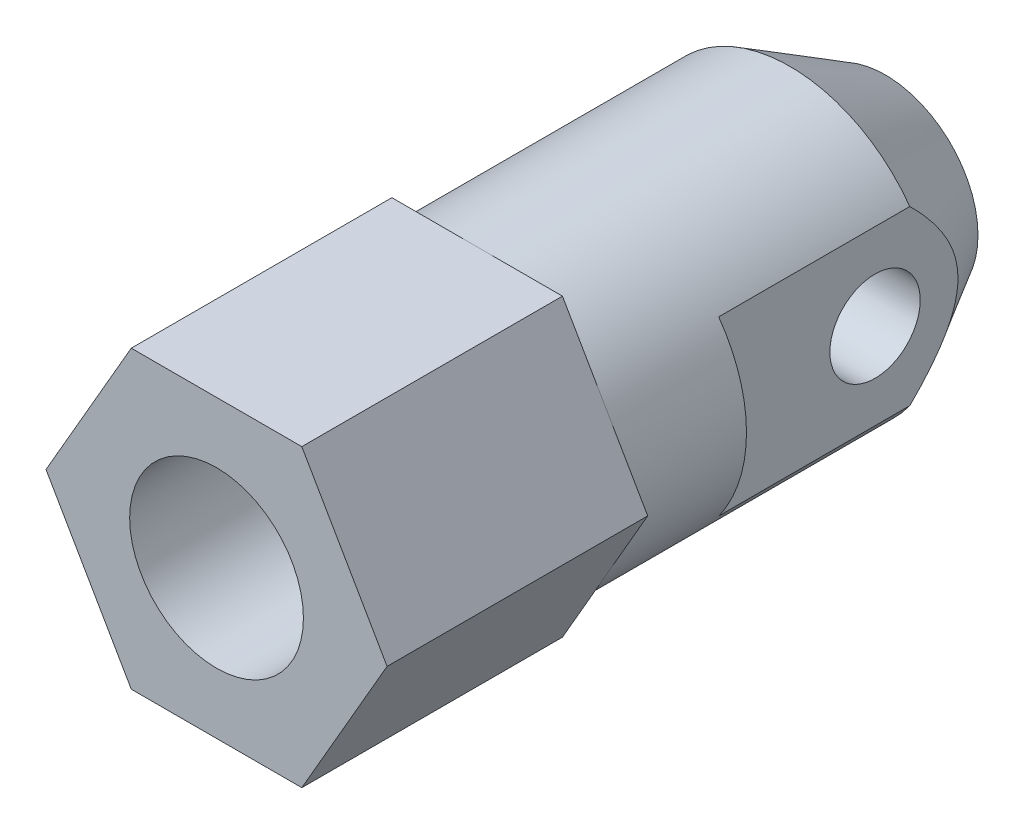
ISO-10303-21;
HEADER;
FILE_DESCRIPTION(('STEP AP214'),'2;1');
FILE_NAME('part.step','',(''),(''),'','','');
FILE_SCHEMA(('AUTOMOTIVE_DESIGN { 1 0 10303 214 1 1 1 1 }'));
ENDSEC;
DATA;
#1=APPLICATION_CONTEXT('core data for automotive mechanical design processes');
#2=APPLICATION_PROTOCOL_DEFINITION('international standard','automotive_design',2000,#1);
#3=PRODUCT_CONTEXT('',#1,'mechanical');
#4=PRODUCT('Part','Part','',(#3));
#5=PRODUCT_RELATED_PRODUCT_CATEGORY('part','',(#4));
#6=PRODUCT_DEFINITION_FORMATION('','',#4);
#7=PRODUCT_DEFINITION_CONTEXT('part definition',#1,'design');
#8=PRODUCT_DEFINITION('design','',#6,#7);
#9=PRODUCT_DEFINITION_SHAPE('','',#8);
#10=(LENGTH_UNIT() NAMED_UNIT(*) SI_UNIT(.MILLI.,.METRE.));
#11=(NAMED_UNIT(*) PLANE_ANGLE_UNIT() SI_UNIT($,.RADIAN.));
#12=(NAMED_UNIT(*) SI_UNIT($,.STERADIAN.) SOLID_ANGLE_UNIT());
#13=UNCERTAINTY_MEASURE_WITH_UNIT(LENGTH_MEASURE(1.E-05),#10,'distance_accuracy_value','');
#14=(GEOMETRIC_REPRESENTATION_CONTEXT(3) GLOBAL_UNCERTAINTY_ASSIGNED_CONTEXT((#13)) GLOBAL_UNIT_ASSIGNED_CONTEXT((#10,
#11,#12)) REPRESENTATION_CONTEXT('',''));
#15=CARTESIAN_POINT('',(0.,0.,0.));
#16=DIRECTION('',(0.,0.,1.));
#17=DIRECTION('',(1.,0.,0.));
#18=AXIS2_PLACEMENT_3D('',#15,#16,#17);
#19=CARTESIAN_POINT('',(0.,0.,11.));
#20=DIRECTION('',(0.,0.,-1.));
#21=DIRECTION('',(1.,0.,0.));
#22=AXIS2_PLACEMENT_3D('',#19,#20,#21);
#23=CYLINDRICAL_SURFACE('',#22,8.5);
#24=CARTESIAN_POINT('',(0.,0.,16.));
#25=DIRECTION('',(0.,0.,-1.));
#26=DIRECTION('',(1.,0.,0.));
#27=AXIS2_PLACEMENT_3D('',#24,#25,#26);
#28=CIRCLE('',#27,8.5);
#29=CARTESIAN_POINT('',(7.36121593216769,4.25,16.));
#30=VERTEX_POINT('',#29);
#31=CARTESIAN_POINT('',(0.,8.5,16.));
#32=VERTEX_POINT('',#31);
#33=EDGE_CURVE('E9',#30,#32,#28,.F.);
#34=ORIENTED_EDGE('',*,*,#33,.F.);
#35=CARTESIAN_POINT('',(7.36121593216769,-4.24999999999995,16.));
#36=VERTEX_POINT('',#35);
#37=EDGE_CURVE('E18',#36,#30,#28,.F.);
#38=ORIENTED_EDGE('',*,*,#37,.F.);
#39=CARTESIAN_POINT('',(0.,-8.5,16.));
#40=VERTEX_POINT('',#39);
#41=EDGE_CURVE('E247',#40,#36,#28,.F.);
#42=ORIENTED_EDGE('',*,*,#41,.F.);
#43=CARTESIAN_POINT('',(-7.36121593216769,-4.24999999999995,16.));
#44=VERTEX_POINT('',#43);
#45=EDGE_CURVE('E252',#44,#40,#28,.F.);
#46=ORIENTED_EDGE('',*,*,#45,.F.);
#47=CARTESIAN_POINT('',(-7.36121593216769,4.25,16.));
#48=VERTEX_POINT('',#47);
#49=EDGE_CURVE('E33',#48,#44,#28,.F.);
#50=ORIENTED_EDGE('',*,*,#49,.F.);
#51=EDGE_CURVE('E23',#32,#48,#28,.F.);
#52=ORIENTED_EDGE('',*,*,#51,.F.);
#53=EDGE_LOOP('',(#34,#38,#42,#46,#50,#52));
#54=FACE_BOUND('',#53,.T.);
#55=CARTESIAN_POINT('',(0.,0.,-2.));
#56=DIRECTION('',(0.,0.,-1.));
#57=DIRECTION('',(1.,0.,0.));
#58=AXIS2_PLACEMENT_3D('',#55,#56,#57);
#59=CIRCLE('',#58,8.5);
#60=CARTESIAN_POINT('',(-6.9,4.96386945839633,-2.));
#61=VERTEX_POINT('',#60);
#62=CARTESIAN_POINT('',(6.9,4.96386945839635,-2.));
#63=VERTEX_POINT('',#62);
#64=EDGE_CURVE('E176',#61,#63,#59,.T.);
#65=ORIENTED_EDGE('',*,*,#64,.F.);
#66=DIRECTION('',(0.,0.,-1.));
#67=VECTOR('',#66,1.);
#68=CARTESIAN_POINT('',(-6.9,4.96386945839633,11.));
#69=LINE('',#68,#67);
#70=CARTESIAN_POINT('',(-6.9,4.96386945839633,9.));
#71=VERTEX_POINT('',#70);
#72=EDGE_CURVE('E163',#61,#71,#69,.F.);
#73=ORIENTED_EDGE('',*,*,#72,.T.);
#74=CARTESIAN_POINT('',(0.,0.,9.));
#75=DIRECTION('',(0.,0.,1.));
#76=DIRECTION('',(-1.,0.,0.));
#77=AXIS2_PLACEMENT_3D('',#74,#75,#76);
#78=CIRCLE('',#77,8.5);
#79=CARTESIAN_POINT('',(-6.9,-4.96386945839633,9.));
#80=VERTEX_POINT('',#79);
#81=EDGE_CURVE('E208',#80,#71,#78,.F.);
#82=ORIENTED_EDGE('',*,*,#81,.F.);
#83=DIRECTION('',(0.,0.,-1.));
#84=VECTOR('',#83,1.);
#85=CARTESIAN_POINT('',(-6.9,-4.96386945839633,11.));
#86=LINE('',#85,#84);
#87=CARTESIAN_POINT('',(-6.9,-4.96386945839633,-2.));
#88=VERTEX_POINT('',#87);
#89=EDGE_CURVE('E160',#80,#88,#86,.T.);
#90=ORIENTED_EDGE('',*,*,#89,.T.);
#91=CARTESIAN_POINT('',(6.9,-4.96386945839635,-2.));
#92=VERTEX_POINT('',#91);
#93=EDGE_CURVE('E177',#92,#88,#59,.T.);
#94=ORIENTED_EDGE('',*,*,#93,.F.);
#95=DIRECTION('',(0.,0.,-1.));
#96=VECTOR('',#95,1.);
#97=CARTESIAN_POINT('',(6.9,-4.96386945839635,11.));
#98=LINE('',#97,#96);
#99=CARTESIAN_POINT('',(6.9,-4.96386945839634,9.));
#100=VERTEX_POINT('',#99);
#101=EDGE_CURVE('E169',#100,#92,#98,.T.);
#102=ORIENTED_EDGE('',*,*,#101,.F.);
#103=CARTESIAN_POINT('',(0.,0.,9.));
#104=DIRECTION('',(0.,0.,-1.));
#105=DIRECTION('',(1.,0.,0.));
#106=AXIS2_PLACEMENT_3D('',#103,#104,#105);
#107=CIRCLE('',#106,8.5);
#108=CARTESIAN_POINT('',(6.9,4.96386945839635,9.));
#109=VERTEX_POINT('',#108);
#110=EDGE_CURVE('E189',#100,#109,#107,.F.);
#111=ORIENTED_EDGE('',*,*,#110,.T.);
#112=DIRECTION('',(0.,0.,-1.));
#113=VECTOR('',#112,1.);
#114=CARTESIAN_POINT('',(6.9,4.96386945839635,11.));
#115=LINE('',#114,#113);
#116=EDGE_CURVE('E171',#63,#109,#115,.F.);
#117=ORIENTED_EDGE('',*,*,#116,.F.);
#118=EDGE_LOOP('',(#65,#73,#82,#90,#94,#102,#111,#117));
#119=FACE_BOUND('',#118,.T.);
#120=ADVANCED_FACE('F14',(#54,#119),#23,.T.);
#121=CARTESIAN_POINT('',(0.,0.,-7.5));
#122=DIRECTION('',(0.,0.,1.));
#123=DIRECTION('',(-1.,0.,0.));
#124=AXIS2_PLACEMENT_3D('',#121,#122,#123);
#125=CONICAL_SURFACE('',#124,5.32457351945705,0.523598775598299);
#126=CARTESIAN_POINT('',(0.,0.,-7.5));
#127=DIRECTION('',(0.,0.,-1.));
#128=DIRECTION('',(1.,0.,0.));
#129=AXIS2_PLACEMENT_3D('',#126,#127,#128);
#130=CIRCLE('',#129,5.32457351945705);
#131=CARTESIAN_POINT('',(5.32457351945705,0.,-7.5));
#132=VERTEX_POINT('',#131);
#133=EDGE_CURVE('E173',#132,#132,#130,.T.);
#134=ORIENTED_EDGE('',*,*,#133,.F.);
#135=EDGE_LOOP('',(#134));
#136=FACE_BOUND('',#135,.T.);
#137=ORIENTED_EDGE('',*,*,#93,.T.);
#138=CARTESIAN_POINT('',(-6.9,11.7761017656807,6.9177821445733));
#139=CARTESIAN_POINT('',(-6.9,11.5231895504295,6.53989229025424));
#140=CARTESIAN_POINT('',(-6.9,11.2688933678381,6.16291885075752));
#141=CARTESIAN_POINT('',(-6.9,10.7568141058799,5.41127304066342));
#142=CARTESIAN_POINT('',(-6.9,10.4990305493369,5.03660099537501));
#143=CARTESIAN_POINT('',(-6.9,9.97780567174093,4.2879456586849));
#144=CARTESIAN_POINT('',(-6.9,9.71434006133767,3.91397924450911));
#145=CARTESIAN_POINT('',(-6.9,9.18227914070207,3.16974757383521));
#146=CARTESIAN_POINT('',(-6.9,8.91368421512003,2.79948204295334));
#147=CARTESIAN_POINT('',(-6.9,8.34932474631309,2.03559566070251));
#148=CARTESIAN_POINT('',(-6.9,8.05305141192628,1.64234974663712));
#149=CARTESIAN_POINT('',(-6.9,7.45080501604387,0.863150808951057));
#150=CARTESIAN_POINT('',(-6.9,7.14482967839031,0.477199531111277));
#151=CARTESIAN_POINT('',(-6.9,6.6766500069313,-0.0933456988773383));
#152=CARTESIAN_POINT('',(-6.9,6.51926271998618,-0.28189290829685));
#153=CARTESIAN_POINT('',(-6.9,6.20075094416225,-0.655798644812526));
#154=CARTESIAN_POINT('',(-6.9,6.03962662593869,-0.841157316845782));
#155=CARTESIAN_POINT('',(-6.9,5.71305851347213,-1.20789739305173));
#156=CARTESIAN_POINT('',(-6.9,5.5476165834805,-1.3892804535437));
#157=CARTESIAN_POINT('',(-6.9,5.21155976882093,-1.7471747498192));
#158=CARTESIAN_POINT('',(-6.9,5.04094553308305,-1.92368659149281));
#159=CARTESIAN_POINT('',(-6.9,4.77365811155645,-2.19053800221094));
#160=CARTESIAN_POINT('',(-6.9,4.679176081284,-2.28307318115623));
#161=CARTESIAN_POINT('',(-6.9,4.48823074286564,-2.46607582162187));
#162=CARTESIAN_POINT('',(-6.9,4.39176740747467,-2.55654325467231));
#163=CARTESIAN_POINT('',(-6.9,4.09900157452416,-2.82448932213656));
#164=CARTESIAN_POINT('',(-6.9,3.89940853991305,-2.99842567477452));
#165=CARTESIAN_POINT('',(-6.9,3.49142942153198,-3.33198709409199));
#166=CARTESIAN_POINT('',(-6.9,3.28313521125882,-3.49172374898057));
#167=CARTESIAN_POINT('',(-6.9,2.85419187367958,-3.79362256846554));
#168=CARTESIAN_POINT('',(-6.9,2.6335552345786,-3.9358020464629));
#169=CARTESIAN_POINT('',(-6.9,2.29148211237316,-4.13085501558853));
#170=CARTESIAN_POINT('',(-6.9,2.17530299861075,-4.19296770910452));
#171=CARTESIAN_POINT('',(-6.9,1.93925517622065,-4.30978771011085));
#172=CARTESIAN_POINT('',(-6.9,1.81938670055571,-4.36449548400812));
#173=CARTESIAN_POINT('',(-6.9,1.57611618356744,-4.46516319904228));
#174=CARTESIAN_POINT('',(-6.9,1.452717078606,-4.51113017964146));
#175=CARTESIAN_POINT('',(-6.9,1.20262499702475,-4.59297504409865));
#176=CARTESIAN_POINT('',(-6.9,1.0759330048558,-4.6288559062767));
#177=CARTESIAN_POINT('',(-6.9,0.818037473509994,-4.68964539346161));
#178=CARTESIAN_POINT('',(-6.9,0.686795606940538,-4.71439340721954));
#179=CARTESIAN_POINT('',(-6.9,0.422520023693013,-4.75106783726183));
#180=CARTESIAN_POINT('',(-6.9,0.289486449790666,-4.76299526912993));
#181=CARTESIAN_POINT('',(-6.9,0.0229498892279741,-4.77344213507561));
#182=CARTESIAN_POINT('',(-6.9,-0.110552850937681,-4.77196778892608));
#183=CARTESIAN_POINT('',(-6.9,-0.376736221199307,-4.75569811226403));
#184=CARTESIAN_POINT('',(-6.9,-0.509416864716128,-4.74090299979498));
#185=CARTESIAN_POINT('',(-6.9,-0.754375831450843,-4.70165804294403));
#186=CARTESIAN_POINT('',(-6.9,-0.866921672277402,-4.67884013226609));
#187=CARTESIAN_POINT('',(-6.9,-1.08992709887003,-4.62461163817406));
#188=CARTESIAN_POINT('',(-6.9,-1.20038639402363,-4.59319986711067));
#189=CARTESIAN_POINT('',(-6.9,-1.41880965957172,-4.52265722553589));
#190=CARTESIAN_POINT('',(-6.9,-1.5267732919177,-4.4835253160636));
#191=CARTESIAN_POINT('',(-6.9,-1.73997734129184,-4.39846034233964));
#192=CARTESIAN_POINT('',(-6.9,-1.84521740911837,-4.35252641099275));
#193=CARTESIAN_POINT('',(-6.9,-2.14889405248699,-4.20954994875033));
#194=CARTESIAN_POINT('',(-6.9,-2.34358024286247,-4.10450453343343));
#195=CARTESIAN_POINT('',(-6.9,-2.72313106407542,-3.87794198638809));
#196=CARTESIAN_POINT('',(-6.9,-2.9079862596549,-3.75640941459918));
#197=CARTESIAN_POINT('',(-6.9,-3.27087204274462,-3.49962347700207));
#198=CARTESIAN_POINT('',(-6.9,-3.44880642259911,-3.36423513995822));
#199=CARTESIAN_POINT('',(-6.9,-3.70983549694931,-3.15405258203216));
#200=CARTESIAN_POINT('',(-6.9,-3.79584813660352,-3.08282486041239));
#201=CARTESIAN_POINT('',(-6.9,-3.96609034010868,-2.93827058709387));
#202=CARTESIAN_POINT('',(-6.9,-4.05031994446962,-2.86494408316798));
#203=CARTESIAN_POINT('',(-6.9,-4.30479429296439,-2.63843203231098));
#204=CARTESIAN_POINT('',(-6.9,-4.47241760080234,-2.48229748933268));
#205=CARTESIAN_POINT('',(-6.9,-4.80186670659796,-2.16400641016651));
#206=CARTESIAN_POINT('',(-6.9,-4.96369131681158,-2.00184865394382));
#207=CARTESIAN_POINT('',(-6.9,-5.28251775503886,-1.67265395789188));
#208=CARTESIAN_POINT('',(-6.9,-5.43951614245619,-1.50561369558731));
#209=CARTESIAN_POINT('',(-6.9,-5.74931497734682,-1.16767507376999));
#210=CARTESIAN_POINT('',(-6.9,-5.90211512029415,-0.996776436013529));
#211=CARTESIAN_POINT('',(-6.9,-6.20467395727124,-0.651184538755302));
#212=CARTESIAN_POINT('',(-6.9,-6.35441915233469,-0.47647948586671));
#213=CARTESIAN_POINT('',(-6.9,-6.65077710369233,-0.124429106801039));
#214=CARTESIAN_POINT('',(-6.9,-6.79738975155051,0.0529163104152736));
#215=CARTESIAN_POINT('',(-6.9,-7.233193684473,0.588285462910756));
#216=CARTESIAN_POINT('',(-6.9,-7.51832840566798,0.949616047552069));
#217=CARTESIAN_POINT('',(-6.9,-7.92704025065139,1.47983874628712));
#218=CARTESIAN_POINT('',(-6.9,-8.05391970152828,1.64621216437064));
#219=CARTESIAN_POINT('',(-6.9,-8.30612549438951,1.98011556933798));
#220=CARTESIAN_POINT('',(-6.9,-8.43145194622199,2.14764547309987));
#221=CARTESIAN_POINT('',(-6.9,-8.80539763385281,2.6518171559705));
#222=CARTESIAN_POINT('',(-6.9,-9.05194736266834,2.98999420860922));
#223=CARTESIAN_POINT('',(-6.9,-9.53839906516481,3.66655023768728));
#224=CARTESIAN_POINT('',(-6.9,-9.77834058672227,4.00490087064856));
#225=CARTESIAN_POINT('',(-6.9,-10.2544964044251,4.68411337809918));
#226=CARTESIAN_POINT('',(-6.9,-10.4907114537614,5.02497472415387));
#227=CARTESIAN_POINT('',(-6.9,-10.7254504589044,5.36683844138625));
#228=B_SPLINE_CURVE_WITH_KNOTS('',3,(#138,#139,#140,#141,#142,#143,#144,#145,#146,#147,#148,
#149,#150,#151,#152,#153,#154,#155,#156,#157,#158,#159,#160,#161,#162,#163,#164,#165,#166,#167,
#168,#169,#170,#171,#172,#173,#174,#175,#176,#177,#178,#179,#180,#181,#182,#183,#184,#185,#186,
#187,#188,#189,#190,#191,#192,#193,#194,#195,#196,#197,#198,#199,#200,#201,#202,#203,#204,#205,
#206,#207,#208,#209,#210,#211,#212,#213,#214,#215,#216,#217,#218,#219,#220,#221,#222,#223,#224,
#225,#226,#227),.UNSPECIFIED.,.F.,.F.,(4,2,2,2,2,2,2,2,2,2,2,2,2,2,2,2,2,2,2,2,2,2,2,2,2,2,2,2,
2,2,2,2,2,2,2,2,2,2,2,2,2,2,2,2,4),(0.,1.36415288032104,2.72849434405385,4.10082414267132,
5.47305143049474,6.95003664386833,8.42737097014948,9.1641417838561,9.90087901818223,
10.6373032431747,11.3736354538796,11.7703519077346,12.1670738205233,12.9608807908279,
13.7477643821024,14.5338657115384,14.9288783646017,15.3238661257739,15.7185344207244,
16.1130860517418,16.5131603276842,16.9132029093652,17.3130598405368,17.7129102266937,
18.0570632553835,18.4012638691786,18.7455108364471,19.0898017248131,19.7522599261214,
20.4153428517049,21.0856446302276,21.4206479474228,21.7556436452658,22.4426581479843,
23.1298125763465,23.8174460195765,24.5051292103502,25.1953821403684,25.8856589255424,
27.2663158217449,27.8940115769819,28.5216626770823,29.777141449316,31.0214951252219,
32.2655939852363),.UNSPECIFIED.);
#229=EDGE_CURVE('E200',#88,#61,#228,.F.);
#230=ORIENTED_EDGE('',*,*,#229,.T.);
#231=ORIENTED_EDGE('',*,*,#64,.T.);
#232=CARTESIAN_POINT('',(6.9,11.7761017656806,6.917782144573));
#233=CARTESIAN_POINT('',(6.9,11.5231895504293,6.53989229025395));
#234=CARTESIAN_POINT('',(6.9,11.2688933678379,6.16291885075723));
#235=CARTESIAN_POINT('',(6.9,10.7568141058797,5.41127304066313));
#236=CARTESIAN_POINT('',(6.9,10.4990305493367,5.03660099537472));
#237=CARTESIAN_POINT('',(6.9,9.97780567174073,4.28794565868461));
#238=CARTESIAN_POINT('',(6.9,9.71434006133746,3.91397924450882));
#239=CARTESIAN_POINT('',(6.9,9.18227914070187,3.16974757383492));
#240=CARTESIAN_POINT('',(6.9,8.91368421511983,2.79948204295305));
#241=CARTESIAN_POINT('',(6.9,8.34932474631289,2.03559566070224));
#242=CARTESIAN_POINT('',(6.9,8.05305141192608,1.64234974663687));
#243=CARTESIAN_POINT('',(6.9,7.45080501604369,0.863150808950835));
#244=CARTESIAN_POINT('',(6.9,7.14482967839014,0.47719953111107));
#245=CARTESIAN_POINT('',(6.9,6.67665000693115,-0.0933456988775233));
#246=CARTESIAN_POINT('',(6.9,6.51926271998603,-0.281892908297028));
#247=CARTESIAN_POINT('',(6.9,6.20075094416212,-0.655798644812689));
#248=CARTESIAN_POINT('',(6.9,6.03962662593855,-0.841157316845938));
#249=CARTESIAN_POINT('',(6.9,5.71305851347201,-1.20789739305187));
#250=CARTESIAN_POINT('',(6.9,5.54761658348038,-1.38928045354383));
#251=CARTESIAN_POINT('',(6.9,5.21155976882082,-1.74717474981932));
#252=CARTESIAN_POINT('',(6.9,5.04094553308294,-1.92368659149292));
#253=CARTESIAN_POINT('',(6.9,4.77365811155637,-2.19053800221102));
#254=CARTESIAN_POINT('',(6.9,4.67917608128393,-2.2830731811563));
#255=CARTESIAN_POINT('',(6.9,4.48823074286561,-2.46607582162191));
#256=CARTESIAN_POINT('',(6.9,4.39176740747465,-2.55654325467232));
#257=CARTESIAN_POINT('',(6.9,4.0990015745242,-2.82448932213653));
#258=CARTESIAN_POINT('',(6.9,3.89940853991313,-2.99842567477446));
#259=CARTESIAN_POINT('',(6.9,3.49142942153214,-3.33198709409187));
#260=CARTESIAN_POINT('',(6.9,3.28313521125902,-3.49172374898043));
#261=CARTESIAN_POINT('',(6.9,2.85419187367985,-3.79362256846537));
#262=CARTESIAN_POINT('',(6.9,2.63355523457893,-3.93580204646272));
#263=CARTESIAN_POINT('',(6.9,2.29148211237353,-4.13085501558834));
#264=CARTESIAN_POINT('',(6.9,2.17530299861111,-4.19296770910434));
#265=CARTESIAN_POINT('',(6.9,1.939255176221,-4.30978771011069));
#266=CARTESIAN_POINT('',(6.9,1.81938670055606,-4.36449548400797));
#267=CARTESIAN_POINT('',(6.9,1.57611618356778,-4.46516319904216));
#268=CARTESIAN_POINT('',(6.9,1.45271707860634,-4.51113017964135));
#269=CARTESIAN_POINT('',(6.9,1.20262499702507,-4.59297504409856));
#270=CARTESIAN_POINT('',(6.9,1.07593300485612,-4.62885590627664));
#271=CARTESIAN_POINT('',(6.9,0.818037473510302,-4.68964539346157));
#272=CARTESIAN_POINT('',(6.9,0.686795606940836,-4.7143934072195));
#273=CARTESIAN_POINT('',(6.9,0.422520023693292,-4.75106783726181));
#274=CARTESIAN_POINT('',(6.9,0.289486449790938,-4.76299526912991));
#275=CARTESIAN_POINT('',(6.9,0.0229498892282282,-4.77344213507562));
#276=CARTESIAN_POINT('',(6.9,-0.110552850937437,-4.7719677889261));
#277=CARTESIAN_POINT('',(6.9,-0.376736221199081,-4.75569811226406));
#278=CARTESIAN_POINT('',(6.9,-0.509416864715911,-4.74090299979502));
#279=CARTESIAN_POINT('',(6.9,-0.754375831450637,-4.70165804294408));
#280=CARTESIAN_POINT('',(6.9,-0.866921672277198,-4.67884013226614));
#281=CARTESIAN_POINT('',(6.9,-1.08992709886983,-4.62461163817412));
#282=CARTESIAN_POINT('',(6.9,-1.20038639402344,-4.59319986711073));
#283=CARTESIAN_POINT('',(6.9,-1.41880965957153,-4.52265722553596));
#284=CARTESIAN_POINT('',(6.9,-1.52677329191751,-4.48352531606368));
#285=CARTESIAN_POINT('',(6.9,-1.73997734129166,-4.39846034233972));
#286=CARTESIAN_POINT('',(6.9,-1.8452174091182,-4.35252641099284));
#287=CARTESIAN_POINT('',(6.9,-2.1488940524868,-4.20954994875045));
#288=CARTESIAN_POINT('',(6.9,-2.34358024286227,-4.10450453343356));
#289=CARTESIAN_POINT('',(6.9,-2.72313106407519,-3.87794198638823));
#290=CARTESIAN_POINT('',(6.9,-2.90798625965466,-3.75640941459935));
#291=CARTESIAN_POINT('',(6.9,-3.27087204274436,-3.49962347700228));
#292=CARTESIAN_POINT('',(6.9,-3.44880642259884,-3.36423513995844));
#293=CARTESIAN_POINT('',(6.9,-3.70983549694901,-3.1540525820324));
#294=CARTESIAN_POINT('',(6.9,-3.79584813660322,-3.08282486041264));
#295=CARTESIAN_POINT('',(6.9,-3.96609034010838,-2.93827058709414));
#296=CARTESIAN_POINT('',(6.9,-4.05031994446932,-2.86494408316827));
#297=CARTESIAN_POINT('',(6.9,-4.30479429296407,-2.63843203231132));
#298=CARTESIAN_POINT('',(6.9,-4.47241760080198,-2.48229748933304));
#299=CARTESIAN_POINT('',(6.9,-4.80186670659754,-2.16400641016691));
#300=CARTESIAN_POINT('',(6.9,-4.96369131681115,-2.00184865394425));
#301=CARTESIAN_POINT('',(6.9,-5.28251775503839,-1.67265395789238));
#302=CARTESIAN_POINT('',(6.9,-5.4395161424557,-1.50561369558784));
#303=CARTESIAN_POINT('',(6.9,-5.74931497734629,-1.16767507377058));
#304=CARTESIAN_POINT('',(6.9,-5.90211512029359,-0.996776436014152));
#305=CARTESIAN_POINT('',(6.9,-6.20467395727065,-0.651184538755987));
#306=CARTESIAN_POINT('',(6.9,-6.35441915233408,-0.476479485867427));
#307=CARTESIAN_POINT('',(6.9,-6.65077710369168,-0.124429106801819));
#308=CARTESIAN_POINT('',(6.9,-6.79738975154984,0.0529163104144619));
#309=CARTESIAN_POINT('',(6.9,-7.23319368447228,0.588285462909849));
#310=CARTESIAN_POINT('',(6.9,-7.51832840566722,0.949616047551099));
#311=CARTESIAN_POINT('',(6.9,-7.92704025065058,1.47983874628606));
#312=CARTESIAN_POINT('',(6.9,-8.05391970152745,1.64621216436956));
#313=CARTESIAN_POINT('',(6.9,-8.30612549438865,1.98011556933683));
#314=CARTESIAN_POINT('',(6.9,-8.43145194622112,2.1476454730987));
#315=CARTESIAN_POINT('',(6.9,-8.80539763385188,2.65181715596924));
#316=CARTESIAN_POINT('',(6.9,-9.05194736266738,2.9899942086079));
#317=CARTESIAN_POINT('',(6.9,-9.53839906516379,3.66655023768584));
#318=CARTESIAN_POINT('',(6.9,-9.77834058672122,4.00490087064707));
#319=CARTESIAN_POINT('',(6.9,-10.254496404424,4.68411337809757));
#320=CARTESIAN_POINT('',(6.9,-10.4907114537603,5.02497472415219));
#321=CARTESIAN_POINT('',(6.9,-10.7254504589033,5.3668384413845));
#322=B_SPLINE_CURVE_WITH_KNOTS('',3,(#232,#233,#234,#235,#236,#237,#238,#239,#240,#241,#242,
#243,#244,#245,#246,#247,#248,#249,#250,#251,#252,#253,#254,#255,#256,#257,#258,#259,#260,#261,
#262,#263,#264,#265,#266,#267,#268,#269,#270,#271,#272,#273,#274,#275,#276,#277,#278,#279,#280,
#281,#282,#283,#284,#285,#286,#287,#288,#289,#290,#291,#292,#293,#294,#295,#296,#297,#298,#299,
#300,#301,#302,#303,#304,#305,#306,#307,#308,#309,#310,#311,#312,#313,#314,#315,#316,#317,#318,
#319,#320,#321),.UNSPECIFIED.,.F.,.F.,(4,2,2,2,2,2,2,2,2,2,2,2,2,2,2,2,2,2,2,2,2,2,2,2,2,2,2,2,
2,2,2,2,2,2,2,2,2,2,2,2,2,2,2,2,4),(0.,1.36415288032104,2.72849434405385,4.10082414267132,
5.47305143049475,6.95003664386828,8.42737097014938,9.16414178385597,9.90087901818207,
10.6373032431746,11.3736354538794,11.7703519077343,12.167073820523,12.9608807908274,
13.7477643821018,14.5338657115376,14.928878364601,15.3238661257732,15.7185344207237,
16.1130860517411,16.5131603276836,16.9132029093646,17.3130598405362,17.7129102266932,
18.0570632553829,18.4012638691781,18.7455108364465,19.0898017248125,19.7522599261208,
20.4153428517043,21.0856446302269,21.420647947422,21.7556436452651,22.4426581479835,
23.1298125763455,23.8174460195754,24.505129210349,25.1953821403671,25.885658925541,
27.2663158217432,27.8940115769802,28.5216626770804,29.777141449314,31.0214951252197,
32.2655939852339),.UNSPECIFIED.);
#323=EDGE_CURVE('E180',#92,#63,#322,.F.);
#324=ORIENTED_EDGE('',*,*,#323,.F.);
#325=EDGE_LOOP('',(#137,#230,#231,#324));
#326=FACE_BOUND('',#325,.T.);
#327=ADVANCED_FACE('F194',(#136,#326),#125,.T.);
#328=CARTESIAN_POINT('',(0.,-5.32457351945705,-7.5));
#329=DIRECTION('',(0.,0.,1.));
#330=DIRECTION('',(-1.,0.,0.));
#331=AXIS2_PLACEMENT_3D('',#328,#329,#330);
#332=PLANE('',#331);
#333=ORIENTED_EDGE('',*,*,#133,.T.);
#334=EDGE_LOOP('',(#333));
#335=FACE_BOUND('',#334,.T.);
#336=ADVANCED_FACE('F16',(#335),#332,.F.);
#337=CARTESIAN_POINT('',(6.9,15.,9.));
#338=DIRECTION('',(0.,0.,-1.));
#339=DIRECTION('',(1.,0.,0.));
#340=AXIS2_PLACEMENT_3D('',#337,#338,#339);
#341=PLANE('',#340);
#342=DIRECTION('',(0.,-1.,0.));
#343=VECTOR('',#342,1.);
#344=CARTESIAN_POINT('',(6.9,15.,9.));
#345=LINE('',#344,#343);
#346=EDGE_CURVE('E166',#109,#100,#345,.T.);
#347=ORIENTED_EDGE('',*,*,#346,.F.);
#348=ORIENTED_EDGE('',*,*,#110,.F.);
#349=EDGE_LOOP('',(#347,#348));
#350=FACE_BOUND('',#349,.T.);
#351=ADVANCED_FACE('F220',(#350),#341,.T.);
#352=CARTESIAN_POINT('',(6.9,15.,9.));
#353=DIRECTION('',(-1.,0.,0.));
#354=DIRECTION('',(0.,0.,-1.));
#355=AXIS2_PLACEMENT_3D('',#352,#353,#354);
#356=PLANE('',#355);
#357=CARTESIAN_POINT('',(6.9,0.,0.));
#358=DIRECTION('',(1.,0.,0.));
#359=DIRECTION('',(0.,0.,1.));
#360=AXIS2_PLACEMENT_3D('',#357,#358,#359);
#361=CIRCLE('',#360,2.6);
#362=CARTESIAN_POINT('',(6.9,0.,2.6));
#363=VERTEX_POINT('',#362);
#364=EDGE_CURVE('E153',#363,#363,#361,.T.);
#365=ORIENTED_EDGE('',*,*,#364,.F.);
#366=EDGE_LOOP('',(#365));
#367=FACE_BOUND('',#366,.T.);
#368=ORIENTED_EDGE('',*,*,#116,.T.);
#369=ORIENTED_EDGE('',*,*,#346,.T.);
#370=ORIENTED_EDGE('',*,*,#101,.T.);
#371=ORIENTED_EDGE('',*,*,#323,.T.);
#372=EDGE_LOOP('',(#368,#369,#370,#371));
#373=FACE_BOUND('',#372,.T.);
#374=ADVANCED_FACE('F191',(#367,#373),#356,.F.);
#375=CARTESIAN_POINT('',(-6.9,15.,9.));
#376=DIRECTION('',(-1.,0.,0.));
#377=DIRECTION('',(0.,0.,-1.));
#378=AXIS2_PLACEMENT_3D('',#375,#376,#377);
#379=PLANE('',#378);
#380=CARTESIAN_POINT('',(-6.9,0.,0.));
#381=DIRECTION('',(-1.,0.,0.));
#382=DIRECTION('',(0.,0.,-1.));
#383=AXIS2_PLACEMENT_3D('',#380,#381,#382);
#384=CIRCLE('',#383,2.6);
#385=CARTESIAN_POINT('',(-6.9,0.,-2.6));
#386=VERTEX_POINT('',#385);
#387=EDGE_CURVE('E156',#386,#386,#384,.T.);
#388=ORIENTED_EDGE('',*,*,#387,.F.);
#389=EDGE_LOOP('',(#388));
#390=FACE_BOUND('',#389,.T.);
#391=ORIENTED_EDGE('',*,*,#229,.F.);
#392=ORIENTED_EDGE('',*,*,#89,.F.);
#393=DIRECTION('',(0.,-1.,0.));
#394=VECTOR('',#393,1.);
#395=CARTESIAN_POINT('',(-6.9,15.,9.));
#396=LINE('',#395,#394);
#397=EDGE_CURVE('E157',#71,#80,#396,.T.);
#398=ORIENTED_EDGE('',*,*,#397,.F.);
#399=ORIENTED_EDGE('',*,*,#72,.F.);
#400=EDGE_LOOP('',(#391,#392,#398,#399));
#401=FACE_BOUND('',#400,.T.);
#402=ADVANCED_FACE('F209',(#390,#401),#379,.T.);
#403=CARTESIAN_POINT('',(-6.9,15.,9.));
#404=DIRECTION('',(0.,0.,1.));
#405=DIRECTION('',(-1.,0.,0.));
#406=AXIS2_PLACEMENT_3D('',#403,#404,#405);
#407=PLANE('',#406);
#408=ORIENTED_EDGE('',*,*,#81,.T.);
#409=ORIENTED_EDGE('',*,*,#397,.T.);
#410=EDGE_LOOP('',(#408,#409));
#411=FACE_BOUND('',#410,.T.);
#412=ADVANCED_FACE('F214',(#411),#407,.F.);
#413=CARTESIAN_POINT('',(-8.5,0.,0.));
#414=DIRECTION('',(1.,0.,0.));
#415=DIRECTION('',(0.,0.,1.));
#416=AXIS2_PLACEMENT_3D('',#413,#414,#415);
#417=CYLINDRICAL_SURFACE('',#416,2.6);
#418=ORIENTED_EDGE('',*,*,#387,.T.);
#419=EDGE_LOOP('',(#418));
#420=FACE_BOUND('',#419,.T.);
#421=ORIENTED_EDGE('',*,*,#364,.T.);
#422=EDGE_LOOP('',(#421));
#423=FACE_BOUND('',#422,.T.);
#424=ADVANCED_FACE('F216',(#420,#423),#417,.F.);
#425=CARTESIAN_POINT('',(-14.7224318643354,-8.5,16.));
#426=DIRECTION('',(0.,0.,-1.));
#427=DIRECTION('',(1.,0.,0.));
#428=AXIS2_PLACEMENT_3D('',#425,#426,#427);
#429=PLANE('',#428);
#430=DIRECTION('',(0.5,-0.86602540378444,0.));
#431=VECTOR('',#430,1.);
#432=CARTESIAN_POINT('',(4.90747728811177,8.5,16.));
#433=LINE('',#432,#431);
#434=CARTESIAN_POINT('',(4.90747728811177,8.5,16.));
#435=VERTEX_POINT('',#434);
#436=EDGE_CURVE('E281',#435,#30,#433,.T.);
#437=ORIENTED_EDGE('',*,*,#436,.T.);
#438=ORIENTED_EDGE('',*,*,#33,.T.);
#439=DIRECTION('',(-1.,0.,0.));
#440=VECTOR('',#439,1.);
#441=CARTESIAN_POINT('',(4.90747728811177,8.5,16.));
#442=LINE('',#441,#440);
#443=EDGE_CURVE('E134',#435,#32,#442,.T.);
#444=ORIENTED_EDGE('',*,*,#443,.F.);
#445=EDGE_LOOP('',(#437,#438,#444));
#446=FACE_BOUND('',#445,.T.);
#447=ADVANCED_FACE('F319',(#446),#429,.T.);
#448=CARTESIAN_POINT('',(-4.90747728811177,8.5,16.));
#449=VERTEX_POINT('',#448);
#450=EDGE_CURVE('E139',#32,#449,#442,.T.);
#451=ORIENTED_EDGE('',*,*,#450,.F.);
#452=ORIENTED_EDGE('',*,*,#51,.T.);
#453=DIRECTION('',(-0.5,-0.86602540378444,0.));
#454=VECTOR('',#453,1.);
#455=CARTESIAN_POINT('',(-4.90747728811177,8.5,16.));
#456=LINE('',#455,#454);
#457=EDGE_CURVE('E265',#449,#48,#456,.T.);
#458=ORIENTED_EDGE('',*,*,#457,.F.);
#459=EDGE_LOOP('',(#451,#452,#458));
#460=FACE_BOUND('',#459,.T.);
#461=ADVANCED_FACE('F264',(#460),#429,.T.);
#462=CARTESIAN_POINT('',(-9.81495457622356,0.,16.));
#463=VERTEX_POINT('',#462);
#464=EDGE_CURVE('E132',#48,#463,#456,.T.);
#465=ORIENTED_EDGE('',*,*,#464,.F.);
#466=ORIENTED_EDGE('',*,*,#49,.T.);
#467=DIRECTION('',(-0.5,0.86602540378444,0.));
#468=VECTOR('',#467,1.);
#469=CARTESIAN_POINT('',(-4.90747728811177,-8.5,16.));
#470=LINE('',#469,#468);
#471=EDGE_CURVE('E267',#44,#463,#470,.T.);
#472=ORIENTED_EDGE('',*,*,#471,.T.);
#473=EDGE_LOOP('',(#465,#466,#472));
#474=FACE_BOUND('',#473,.T.);
#475=ADVANCED_FACE('F266',(#474),#429,.T.);
#476=CARTESIAN_POINT('',(-4.90747728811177,-8.5,16.));
#477=VERTEX_POINT('',#476);
#478=EDGE_CURVE('E269',#477,#44,#470,.T.);
#479=ORIENTED_EDGE('',*,*,#478,.T.);
#480=ORIENTED_EDGE('',*,*,#45,.T.);
#481=DIRECTION('',(-1.,0.,0.));
#482=VECTOR('',#481,1.);
#483=CARTESIAN_POINT('',(4.90747728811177,-8.5,16.));
#484=LINE('',#483,#482);
#485=EDGE_CURVE('E274',#40,#477,#484,.T.);
#486=ORIENTED_EDGE('',*,*,#485,.T.);
#487=EDGE_LOOP('',(#479,#480,#486));
#488=FACE_BOUND('',#487,.T.);
#489=ADVANCED_FACE('F329',(#488),#429,.T.);
#490=CARTESIAN_POINT('',(4.90747728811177,-8.5,16.));
#491=VERTEX_POINT('',#490);
#492=EDGE_CURVE('E275',#491,#40,#484,.T.);
#493=ORIENTED_EDGE('',*,*,#492,.T.);
#494=ORIENTED_EDGE('',*,*,#41,.T.);
#495=DIRECTION('',(0.5,0.86602540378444,0.));
#496=VECTOR('',#495,1.);
#497=CARTESIAN_POINT('',(4.90747728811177,-8.5,16.));
#498=LINE('',#497,#496);
#499=EDGE_CURVE('E278',#491,#36,#498,.T.);
#500=ORIENTED_EDGE('',*,*,#499,.F.);
#501=EDGE_LOOP('',(#493,#494,#500));
#502=FACE_BOUND('',#501,.T.);
#503=ADVANCED_FACE('F320',(#502),#429,.T.);
#504=CARTESIAN_POINT('',(-4.90747728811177,8.5,16.));
#505=DIRECTION('',(-0.86602540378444,0.5,0.));
#506=DIRECTION('',(0.5,0.86602540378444,0.));
#507=AXIS2_PLACEMENT_3D('',#504,#505,#506);
#508=PLANE('',#507);
#509=DIRECTION('',(0.,0.,1.));
#510=VECTOR('',#509,1.);
#511=CARTESIAN_POINT('',(-9.81495457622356,0.,16.));
#512=LINE('',#511,#510);
#513=CARTESIAN_POINT('',(-9.81495457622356,0.,31.));
#514=VERTEX_POINT('',#513);
#515=EDGE_CURVE('E123',#463,#514,#512,.T.);
#516=ORIENTED_EDGE('',*,*,#515,.T.);
#517=DIRECTION('',(-0.5,-0.86602540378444,0.));
#518=VECTOR('',#517,1.);
#519=CARTESIAN_POINT('',(-4.90747728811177,8.5,31.));
#520=LINE('',#519,#518);
#521=CARTESIAN_POINT('',(-4.90747728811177,8.5,31.));
#522=VERTEX_POINT('',#521);
#523=EDGE_CURVE('E105',#522,#514,#520,.T.);
#524=ORIENTED_EDGE('',*,*,#523,.F.);
#525=DIRECTION('',(0.,0.,1.));
#526=VECTOR('',#525,1.);
#527=CARTESIAN_POINT('',(-4.90747728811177,8.5,16.));
#528=LINE('',#527,#526);
#529=EDGE_CURVE('E151',#449,#522,#528,.T.);
#530=ORIENTED_EDGE('',*,*,#529,.F.);
#531=ORIENTED_EDGE('',*,*,#457,.T.);
#532=ORIENTED_EDGE('',*,*,#464,.T.);
#533=EDGE_LOOP('',(#516,#524,#530,#531,#532));
#534=FACE_BOUND('',#533,.T.);
#535=ADVANCED_FACE('F129',(#534),#508,.T.);
#536=CARTESIAN_POINT('',(4.90747728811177,8.5,16.));
#537=DIRECTION('',(0.,1.,0.));
#538=DIRECTION('',(0.,0.,1.));
#539=AXIS2_PLACEMENT_3D('',#536,#537,#538);
#540=PLANE('',#539);
#541=ORIENTED_EDGE('',*,*,#529,.T.);
#542=DIRECTION('',(-1.,0.,0.));
#543=VECTOR('',#542,1.);
#544=CARTESIAN_POINT('',(4.90747728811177,8.5,31.));
#545=LINE('',#544,#543);
#546=CARTESIAN_POINT('',(4.90747728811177,8.5,31.));
#547=VERTEX_POINT('',#546);
#548=EDGE_CURVE('E111',#547,#522,#545,.T.);
#549=ORIENTED_EDGE('',*,*,#548,.F.);
#550=DIRECTION('',(0.,0.,1.));
#551=VECTOR('',#550,1.);
#552=CARTESIAN_POINT('',(4.90747728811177,8.5,16.));
#553=LINE('',#552,#551);
#554=EDGE_CURVE('E148',#435,#547,#553,.T.);
#555=ORIENTED_EDGE('',*,*,#554,.F.);
#556=ORIENTED_EDGE('',*,*,#443,.T.);
#557=ORIENTED_EDGE('',*,*,#450,.T.);
#558=EDGE_LOOP('',(#541,#549,#555,#556,#557));
#559=FACE_BOUND('',#558,.T.);
#560=ADVANCED_FACE('F334',(#559),#540,.T.);
#561=CARTESIAN_POINT('',(4.90747728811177,8.5,16.));
#562=DIRECTION('',(-0.86602540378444,-0.5,0.));
#563=DIRECTION('',(-0.5,0.86602540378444,0.));
#564=AXIS2_PLACEMENT_3D('',#561,#562,#563);
#565=PLANE('',#564);
#566=CARTESIAN_POINT('',(9.81495457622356,0.,16.));
#567=VERTEX_POINT('',#566);
#568=EDGE_CURVE('E280',#30,#567,#433,.T.);
#569=ORIENTED_EDGE('',*,*,#568,.F.);
#570=ORIENTED_EDGE('',*,*,#436,.F.);
#571=ORIENTED_EDGE('',*,*,#554,.T.);
#572=DIRECTION('',(0.5,-0.86602540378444,0.));
#573=VECTOR('',#572,1.);
#574=CARTESIAN_POINT('',(4.90747728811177,8.5,31.));
#575=LINE('',#574,#573);
#576=CARTESIAN_POINT('',(9.81495457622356,0.,31.));
#577=VERTEX_POINT('',#576);
#578=EDGE_CURVE('E295',#547,#577,#575,.T.);
#579=ORIENTED_EDGE('',*,*,#578,.T.);
#580=DIRECTION('',(0.,0.,1.));
#581=VECTOR('',#580,1.);
#582=CARTESIAN_POINT('',(9.81495457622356,0.,16.));
#583=LINE('',#582,#581);
#584=EDGE_CURVE('E145',#567,#577,#583,.T.);
#585=ORIENTED_EDGE('',*,*,#584,.F.);
#586=EDGE_LOOP('',(#569,#570,#571,#579,#585));
#587=FACE_BOUND('',#586,.T.);
#588=ADVANCED_FACE('F294',(#587),#565,.F.);
#589=CARTESIAN_POINT('',(4.90747728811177,-8.5,16.));
#590=DIRECTION('',(0.86602540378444,-0.5,0.));
#591=DIRECTION('',(-0.5,-0.86602540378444,0.));
#592=AXIS2_PLACEMENT_3D('',#589,#590,#591);
#593=PLANE('',#592);
#594=ORIENTED_EDGE('',*,*,#584,.T.);
#595=DIRECTION('',(0.5,0.86602540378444,0.));
#596=VECTOR('',#595,1.);
#597=CARTESIAN_POINT('',(4.90747728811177,-8.5,31.));
#598=LINE('',#597,#596);
#599=CARTESIAN_POINT('',(4.90747728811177,-8.5,31.));
#600=VERTEX_POINT('',#599);
#601=EDGE_CURVE('E296',#600,#577,#598,.T.);
#602=ORIENTED_EDGE('',*,*,#601,.F.);
#603=DIRECTION('',(0.,0.,1.));
#604=VECTOR('',#603,1.);
#605=CARTESIAN_POINT('',(4.90747728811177,-8.5,16.));
#606=LINE('',#605,#604);
#607=EDGE_CURVE('E136',#491,#600,#606,.T.);
#608=ORIENTED_EDGE('',*,*,#607,.F.);
#609=ORIENTED_EDGE('',*,*,#499,.T.);
#610=EDGE_CURVE('E277',#36,#567,#498,.T.);
#611=ORIENTED_EDGE('',*,*,#610,.T.);
#612=EDGE_LOOP('',(#594,#602,#608,#609,#611));
#613=FACE_BOUND('',#612,.T.);
#614=ADVANCED_FACE('F291',(#613),#593,.T.);
#615=CARTESIAN_POINT('',(4.90747728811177,-8.5,16.));
#616=DIRECTION('',(0.,1.,0.));
#617=DIRECTION('',(0.,0.,1.));
#618=AXIS2_PLACEMENT_3D('',#615,#616,#617);
#619=PLANE('',#618);
#620=ORIENTED_EDGE('',*,*,#485,.F.);
#621=ORIENTED_EDGE('',*,*,#492,.F.);
#622=ORIENTED_EDGE('',*,*,#607,.T.);
#623=DIRECTION('',(-1.,0.,0.));
#624=VECTOR('',#623,1.);
#625=CARTESIAN_POINT('',(4.90747728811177,-8.5,31.));
#626=LINE('',#625,#624);
#627=CARTESIAN_POINT('',(-4.90747728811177,-8.5,31.));
#628=VERTEX_POINT('',#627);
#629=EDGE_CURVE('E127',#600,#628,#626,.T.);
#630=ORIENTED_EDGE('',*,*,#629,.T.);
#631=DIRECTION('',(0.,0.,1.));
#632=VECTOR('',#631,1.);
#633=CARTESIAN_POINT('',(-4.90747728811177,-8.5,16.));
#634=LINE('',#633,#632);
#635=EDGE_CURVE('E126',#477,#628,#634,.T.);
#636=ORIENTED_EDGE('',*,*,#635,.F.);
#637=EDGE_LOOP('',(#620,#621,#622,#630,#636));
#638=FACE_BOUND('',#637,.T.);
#639=ADVANCED_FACE('F324',(#638),#619,.F.);
#640=CARTESIAN_POINT('',(-4.90747728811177,-8.5,16.));
#641=DIRECTION('',(0.86602540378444,0.5,0.));
#642=DIRECTION('',(0.5,-0.86602540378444,0.));
#643=AXIS2_PLACEMENT_3D('',#640,#641,#642);
#644=PLANE('',#643);
#645=ORIENTED_EDGE('',*,*,#471,.F.);
#646=ORIENTED_EDGE('',*,*,#478,.F.);
#647=ORIENTED_EDGE('',*,*,#635,.T.);
#648=DIRECTION('',(-0.5,0.86602540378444,0.));
#649=VECTOR('',#648,1.);
#650=CARTESIAN_POINT('',(-4.90747728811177,-8.5,31.));
#651=LINE('',#650,#649);
#652=EDGE_CURVE('E108',#628,#514,#651,.T.);
#653=ORIENTED_EDGE('',*,*,#652,.T.);
#654=ORIENTED_EDGE('',*,*,#515,.F.);
#655=EDGE_LOOP('',(#645,#646,#647,#653,#654));
#656=FACE_BOUND('',#655,.T.);
#657=ADVANCED_FACE('F122',(#656),#644,.F.);
#658=ORIENTED_EDGE('',*,*,#610,.F.);
#659=ORIENTED_EDGE('',*,*,#37,.T.);
#660=ORIENTED_EDGE('',*,*,#568,.T.);
#661=EDGE_LOOP('',(#658,#659,#660));
#662=FACE_BOUND('',#661,.T.);
#663=ADVANCED_FACE('F287',(#662),#429,.T.);
#664=CARTESIAN_POINT('',(0.,0.,31.));
#665=DIRECTION('',(0.,0.,-1.));
#666=DIRECTION('',(1.,0.,0.));
#667=AXIS2_PLACEMENT_3D('',#664,#665,#666);
#668=PLANE('',#667);
#669=CARTESIAN_POINT('',(0.,0.,31.));
#670=DIRECTION('',(0.,0.,1.));
#671=DIRECTION('',(-1.,0.,0.));
#672=AXIS2_PLACEMENT_3D('',#669,#670,#671);
#673=CIRCLE('',#672,5.);
#674=CARTESIAN_POINT('',(-5.,0.,31.));
#675=VERTEX_POINT('',#674);
#676=EDGE_CURVE('E116',#675,#675,#673,.T.);
#677=ORIENTED_EDGE('',*,*,#676,.F.);
#678=EDGE_LOOP('',(#677));
#679=FACE_BOUND('',#678,.T.);
#680=ORIENTED_EDGE('',*,*,#578,.F.);
#681=ORIENTED_EDGE('',*,*,#548,.T.);
#682=ORIENTED_EDGE('',*,*,#523,.T.);
#683=ORIENTED_EDGE('',*,*,#652,.F.);
#684=ORIENTED_EDGE('',*,*,#629,.F.);
#685=ORIENTED_EDGE('',*,*,#601,.T.);
#686=EDGE_LOOP('',(#680,#681,#682,#683,#684,#685));
#687=FACE_BOUND('',#686,.T.);
#688=ADVANCED_FACE('F107',(#679,#687),#668,.F.);
#689=CARTESIAN_POINT('',(0.,0.,11.));
#690=DIRECTION('',(0.,0.,1.));
#691=DIRECTION('',(-1.,0.,0.));
#692=AXIS2_PLACEMENT_3D('',#689,#690,#691);
#693=CYLINDRICAL_SURFACE('',#692,5.);
#694=CARTESIAN_POINT('',(0.,0.,16.));
#695=DIRECTION('',(0.,0.,1.));
#696=DIRECTION('',(-1.,0.,0.));
#697=AXIS2_PLACEMENT_3D('',#694,#695,#696);
#698=CIRCLE('',#697,5.);
#699=CARTESIAN_POINT('',(-5.,0.,16.));
#700=VERTEX_POINT('',#699);
#701=EDGE_CURVE('E302',#700,#700,#698,.T.);
#702=ORIENTED_EDGE('',*,*,#701,.F.);
#703=EDGE_LOOP('',(#702));
#704=FACE_BOUND('',#703,.T.);
#705=ORIENTED_EDGE('',*,*,#676,.T.);
#706=EDGE_LOOP('',(#705));
#707=FACE_BOUND('',#706,.T.);
#708=ADVANCED_FACE('F308',(#704,#707),#693,.F.);
#709=CARTESIAN_POINT('',(0.,0.,16.));
#710=DIRECTION('',(0.,0.,1.));
#711=DIRECTION('',(-1.,0.,0.));
#712=AXIS2_PLACEMENT_3D('',#709,#710,#711);
#713=PLANE('',#712);
#714=ORIENTED_EDGE('',*,*,#701,.T.);
#715=EDGE_LOOP('',(#714));
#716=FACE_BOUND('',#715,.T.);
#717=ADVANCED_FACE('F306',(#716),#713,.T.);
#718=CLOSED_SHELL('',(#120,#327,#336,#351,#374,#402,#412,#424,#447,#461,#475,#489,#503,#535,
#560,#588,#614,#639,#657,#663,#688,#708,#717));
#719=MANIFOLD_SOLID_BREP('B1',#718);
#720=ADVANCED_BREP_SHAPE_REPRESENTATION('',(#18,#719),#14);
#721=SHAPE_DEFINITION_REPRESENTATION(#9,#720);
ENDSEC;
END-ISO-10303-21;
